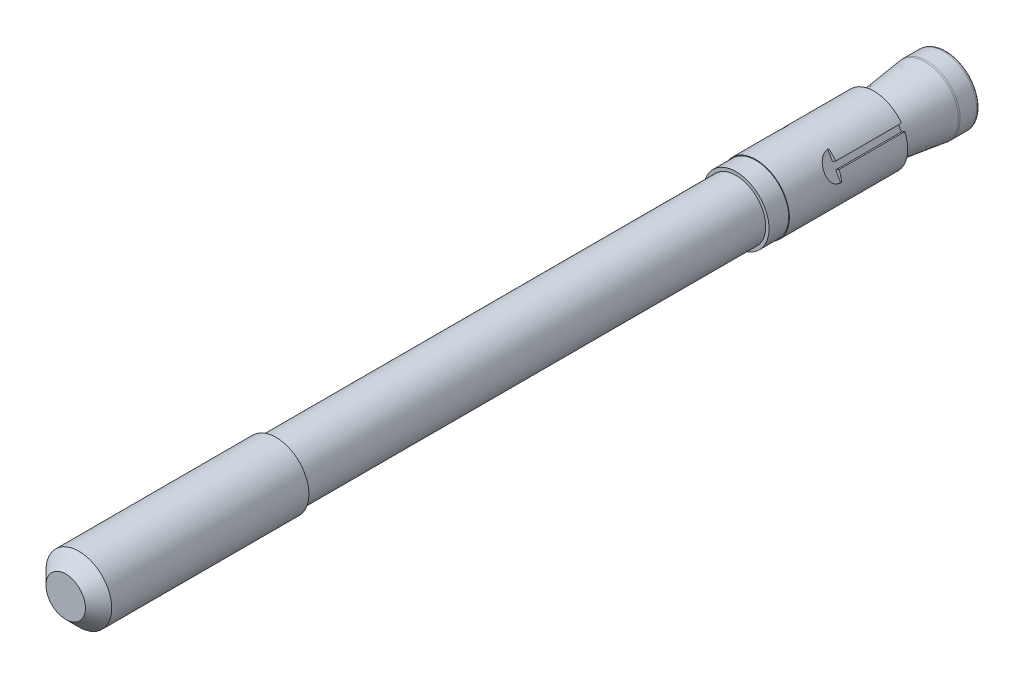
ISO-10303-21;
HEADER;
FILE_DESCRIPTION(('STEP AP214'),'2;1');
FILE_NAME('part.step','',(''),(''),'','','');
FILE_SCHEMA(('AUTOMOTIVE_DESIGN { 1 0 10303 214 1 1 1 1 }'));
ENDSEC;
DATA;
#1=APPLICATION_CONTEXT('core data for automotive mechanical design processes');
#2=APPLICATION_PROTOCOL_DEFINITION('international standard','automotive_design',2000,#1);
#3=PRODUCT_CONTEXT('',#1,'mechanical');
#4=PRODUCT('Part','Part','',(#3));
#5=PRODUCT_RELATED_PRODUCT_CATEGORY('part','',(#4));
#6=PRODUCT_DEFINITION_FORMATION('','',#4);
#7=PRODUCT_DEFINITION_CONTEXT('part definition',#1,'design');
#8=PRODUCT_DEFINITION('design','',#6,#7);
#9=PRODUCT_DEFINITION_SHAPE('','',#8);
#10=(LENGTH_UNIT() NAMED_UNIT(*) SI_UNIT(.MILLI.,.METRE.));
#11=(NAMED_UNIT(*) PLANE_ANGLE_UNIT() SI_UNIT($,.RADIAN.));
#12=(NAMED_UNIT(*) SI_UNIT($,.STERADIAN.) SOLID_ANGLE_UNIT());
#13=UNCERTAINTY_MEASURE_WITH_UNIT(LENGTH_MEASURE(1.E-05),#10,'distance_accuracy_value','');
#14=(GEOMETRIC_REPRESENTATION_CONTEXT(3) GLOBAL_UNCERTAINTY_ASSIGNED_CONTEXT((#13)) GLOBAL_UNIT_ASSIGNED_CONTEXT((#10,
#11,#12)) REPRESENTATION_CONTEXT('',''));
#15=CARTESIAN_POINT('',(0.,0.,0.));
#16=DIRECTION('',(0.,0.,1.));
#17=DIRECTION('',(1.,0.,0.));
#18=AXIS2_PLACEMENT_3D('',#15,#16,#17);
#19=CARTESIAN_POINT('',(0.,-2.53157326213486,-102.));
#20=DIRECTION('',(0.,0.,-1.));
#21=DIRECTION('',(-1.,0.,0.));
#22=AXIS2_PLACEMENT_3D('',#19,#20,#21);
#23=PLANE('',#22);
#24=CARTESIAN_POINT('',(0.,0.012284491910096,-102.));
#25=DIRECTION('',(0.,0.,1.));
#26=DIRECTION('',(0.,-1.,0.));
#27=AXIS2_PLACEMENT_3D('',#24,#25,#26);
#28=CIRCLE('',#27,4.5877155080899);
#29=CARTESIAN_POINT('',(0.,-4.57543101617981,-102.));
#30=VERTEX_POINT('',#29);
#31=EDGE_CURVE('E257',#30,#30,#28,.T.);
#32=ORIENTED_EDGE('',*,*,#31,.F.);
#33=EDGE_LOOP('',(#32));
#34=FACE_BOUND('',#33,.T.);
#35=ADVANCED_FACE('F15',(#34),#23,.T.);
#36=CARTESIAN_POINT('',(0.,0.012284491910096,-101.5));
#37=DIRECTION('',(0.,0.,1.));
#38=DIRECTION('',(1.,0.,0.));
#39=AXIS2_PLACEMENT_3D('',#36,#37,#38);
#40=TOROIDAL_SURFACE('',#39,4.5877155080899,0.5);
#41=CARTESIAN_POINT('',(0.,0.012284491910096,-101.5));
#42=DIRECTION('',(0.,0.,1.));
#43=DIRECTION('',(0.,-1.,0.));
#44=AXIS2_PLACEMENT_3D('',#41,#42,#43);
#45=CIRCLE('',#44,5.0877155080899);
#46=CARTESIAN_POINT('',(0.,-5.07543101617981,-101.5));
#47=VERTEX_POINT('',#46);
#48=EDGE_CURVE('E785',#47,#47,#45,.T.);
#49=ORIENTED_EDGE('',*,*,#48,.F.);
#50=EDGE_LOOP('',(#49));
#51=FACE_BOUND('',#50,.T.);
#52=ORIENTED_EDGE('',*,*,#31,.T.);
#53=EDGE_LOOP('',(#52));
#54=FACE_BOUND('',#53,.T.);
#55=ADVANCED_FACE('F241',(#51,#54),#40,.T.);
#56=CARTESIAN_POINT('',(0.,0.012284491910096,-100.5));
#57=DIRECTION('',(0.,0.,1.));
#58=DIRECTION('',(0.,-1.,0.));
#59=AXIS2_PLACEMENT_3D('',#56,#57,#58);
#60=CYLINDRICAL_SURFACE('',#59,5.0877155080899);
#61=ORIENTED_EDGE('',*,*,#48,.T.);
#62=EDGE_LOOP('',(#61));
#63=FACE_BOUND('',#62,.T.);
#64=CARTESIAN_POINT('',(0.,0.012284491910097,-99.));
#65=DIRECTION('',(0.,0.,1.));
#66=DIRECTION('',(1.,0.,0.));
#67=AXIS2_PLACEMENT_3D('',#64,#65,#66);
#68=CIRCLE('',#67,5.0877155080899);
#69=CARTESIAN_POINT('',(5.0877155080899,0.012284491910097,-99.));
#70=VERTEX_POINT('',#69);
#71=EDGE_CURVE('E224',#70,#70,#68,.T.);
#72=ORIENTED_EDGE('',*,*,#71,.F.);
#73=EDGE_LOOP('',(#72));
#74=FACE_BOUND('',#73,.T.);
#75=ADVANCED_FACE('F237',(#63,#74),#60,.T.);
#76=CARTESIAN_POINT('',(0.,0.012284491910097,-99.));
#77=DIRECTION('',(0.,0.,1.));
#78=DIRECTION('',(1.,0.,0.));
#79=AXIS2_PLACEMENT_3D('',#76,#77,#78);
#80=TOROIDAL_SURFACE('',#79,3.08771550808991,2.);
#81=ORIENTED_EDGE('',*,*,#71,.T.);
#82=EDGE_LOOP('',(#81));
#83=FACE_BOUND('',#82,.T.);
#84=CARTESIAN_POINT('',(0.,0.0122844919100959,-98.7480076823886));
#85=DIRECTION('',(0.,0.,-1.));
#86=DIRECTION('',(0.,-1.,0.));
#87=AXIS2_PLACEMENT_3D('',#84,#85,#86);
#88=CIRCLE('',#87,5.07177696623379);
#89=CARTESIAN_POINT('',(0.,-5.05949247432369,-98.7480076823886));
#90=VERTEX_POINT('',#89);
#91=EDGE_CURVE('E614',#90,#90,#88,.F.);
#92=ORIENTED_EDGE('',*,*,#91,.F.);
#93=EDGE_LOOP('',(#92));
#94=FACE_BOUND('',#93,.T.);
#95=ADVANCED_FACE('F232',(#83,#94),#80,.T.);
#96=CARTESIAN_POINT('',(3.89711431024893,2.25000001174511,-84.394199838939));
#97=DIRECTION('',(0.866025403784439,0.5,0.));
#98=DIRECTION('',(-0.5,0.866025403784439,0.));
#99=AXIS2_PLACEMENT_3D('',#96,#97,#98);
#100=PLANE('',#99);
#101=DIRECTION('',(0.,0.,1.));
#102=VECTOR('',#101,1.);
#103=CARTESIAN_POINT('',(3.64711431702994,2.68301270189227,-81.));
#104=LINE('',#103,#102);
#105=CARTESIAN_POINT('',(3.64711431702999,2.6830127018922,-91.));
#106=VERTEX_POINT('',#105);
#107=CARTESIAN_POINT('',(3.64711431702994,2.68301270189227,-81.));
#108=VERTEX_POINT('',#107);
#109=EDGE_CURVE('E610',#106,#108,#104,.T.);
#110=ORIENTED_EDGE('',*,*,#109,.T.);
#111=DIRECTION('',(-0.5,0.866025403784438,0.));
#112=VECTOR('',#111,1.);
#113=CARTESIAN_POINT('',(3.64711431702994,2.68301270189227,-81.));
#114=LINE('',#113,#112);
#115=CARTESIAN_POINT('',(2.89711431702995,3.98205080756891,-81.));
#116=VERTEX_POINT('',#115);
#117=EDGE_CURVE('E133',#108,#116,#114,.T.);
#118=ORIENTED_EDGE('',*,*,#117,.T.);
#119=CARTESIAN_POINT('',(3.89711431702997,2.25,-80.9999996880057));
#120=DIRECTION('',(0.866025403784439,0.5,0.));
#121=DIRECTION('',(-0.5,0.866025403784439,0.));
#122=AXIS2_PLACEMENT_3D('',#119,#120,#121);
#123=CIRCLE('',#122,2.);
#124=CARTESIAN_POINT('',(4.89711431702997,0.517949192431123,-80.9999996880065));
#125=VERTEX_POINT('',#124);
#126=EDGE_CURVE('E19',#116,#125,#123,.T.);
#127=ORIENTED_EDGE('',*,*,#126,.T.);
#128=DIRECTION('',(-0.5,0.866025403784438,0.));
#129=VECTOR('',#128,1.);
#130=CARTESIAN_POINT('',(4.89711431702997,0.517949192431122,-80.9999996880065));
#131=LINE('',#130,#129);
#132=CARTESIAN_POINT('',(4.14711431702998,1.81698729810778,-80.9999996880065));
#133=VERTEX_POINT('',#132);
#134=EDGE_CURVE('E141',#125,#133,#131,.T.);
#135=ORIENTED_EDGE('',*,*,#134,.T.);
#136=DIRECTION('',(0.,0.,1.));
#137=VECTOR('',#136,1.);
#138=CARTESIAN_POINT('',(4.14711431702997,1.81698729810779,-91.));
#139=LINE('',#138,#137);
#140=CARTESIAN_POINT('',(4.14711431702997,1.81698729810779,-91.));
#141=VERTEX_POINT('',#140);
#142=EDGE_CURVE('E227',#133,#141,#139,.F.);
#143=ORIENTED_EDGE('',*,*,#142,.T.);
#144=DIRECTION('',(-0.5,0.866025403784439,0.));
#145=VECTOR('',#144,1.);
#146=CARTESIAN_POINT('',(3.89711431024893,2.25000001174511,-91.));
#147=LINE('',#146,#145);
#148=EDGE_CURVE('E214',#141,#106,#147,.T.);
#149=ORIENTED_EDGE('',*,*,#148,.T.);
#150=EDGE_LOOP('',(#110,#118,#127,#135,#143,#149));
#151=FACE_BOUND('',#150,.T.);
#152=ADVANCED_FACE('F236',(#151),#100,.T.);
#153=CARTESIAN_POINT('',(-3.89711432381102,2.24999998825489,-84.394199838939));
#154=DIRECTION('',(0.866025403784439,-0.5,0.));
#155=DIRECTION('',(0.5,0.866025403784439,0.));
#156=AXIS2_PLACEMENT_3D('',#153,#154,#155);
#157=PLANE('',#156);
#158=DIRECTION('',(-0.5,-0.866025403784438,0.));
#159=VECTOR('',#158,1.);
#160=CARTESIAN_POINT('',(-2.89711431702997,3.98205080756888,-80.9999996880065));
#161=LINE('',#160,#159);
#162=CARTESIAN_POINT('',(-2.89711431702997,3.98205080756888,-80.9999996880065));
#163=VERTEX_POINT('',#162);
#164=CARTESIAN_POINT('',(-3.64711431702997,2.68301270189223,-80.9999996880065));
#165=VERTEX_POINT('',#164);
#166=EDGE_CURVE('E215',#163,#165,#161,.T.);
#167=ORIENTED_EDGE('',*,*,#166,.T.);
#168=DIRECTION('',(0.,0.,1.));
#169=VECTOR('',#168,1.);
#170=CARTESIAN_POINT('',(-3.64711431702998,2.68301270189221,-91.));
#171=LINE('',#170,#169);
#172=CARTESIAN_POINT('',(-3.64711431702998,2.68301270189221,-91.));
#173=VERTEX_POINT('',#172);
#174=EDGE_CURVE('E219',#165,#173,#171,.F.);
#175=ORIENTED_EDGE('',*,*,#174,.T.);
#176=DIRECTION('',(0.5,0.866025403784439,0.));
#177=VECTOR('',#176,1.);
#178=CARTESIAN_POINT('',(-3.89711432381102,2.24999998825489,-91.));
#179=LINE('',#178,#177);
#180=CARTESIAN_POINT('',(-4.14711431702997,1.81698729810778,-91.));
#181=VERTEX_POINT('',#180);
#182=EDGE_CURVE('E211',#181,#173,#179,.T.);
#183=ORIENTED_EDGE('',*,*,#182,.F.);
#184=DIRECTION('',(0.,0.,1.));
#185=VECTOR('',#184,1.);
#186=CARTESIAN_POINT('',(-4.14711431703,1.81698729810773,-81.));
#187=LINE('',#186,#185);
#188=CARTESIAN_POINT('',(-4.14711431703,1.81698729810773,-81.));
#189=VERTEX_POINT('',#188);
#190=EDGE_CURVE('E589',#181,#189,#187,.T.);
#191=ORIENTED_EDGE('',*,*,#190,.T.);
#192=DIRECTION('',(-0.5,-0.866025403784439,0.));
#193=VECTOR('',#192,1.);
#194=CARTESIAN_POINT('',(-4.14711431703,1.81698729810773,-81.));
#195=LINE('',#194,#193);
#196=CARTESIAN_POINT('',(-4.89711431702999,0.517949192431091,-81.));
#197=VERTEX_POINT('',#196);
#198=EDGE_CURVE('E207',#189,#197,#195,.T.);
#199=ORIENTED_EDGE('',*,*,#198,.T.);
#200=CARTESIAN_POINT('',(-3.89711431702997,2.25,-80.9999996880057));
#201=DIRECTION('',(-0.866025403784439,0.5,0.));
#202=DIRECTION('',(-0.5,-0.866025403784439,0.));
#203=AXIS2_PLACEMENT_3D('',#200,#201,#202);
#204=CIRCLE('',#203,2.);
#205=EDGE_CURVE('E598',#197,#163,#204,.T.);
#206=ORIENTED_EDGE('',*,*,#205,.T.);
#207=EDGE_LOOP('',(#167,#175,#183,#191,#199,#206));
#208=FACE_BOUND('',#207,.T.);
#209=ADVANCED_FACE('F388',(#208),#157,.F.);
#210=CARTESIAN_POINT('',(0.,-4.5,-81.8452759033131));
#211=DIRECTION('',(0.,1.,0.));
#212=DIRECTION('',(0.,0.,1.));
#213=AXIS2_PLACEMENT_3D('',#210,#211,#212);
#214=PLANE('',#213);
#215=DIRECTION('',(0.,0.,1.));
#216=VECTOR('',#215,1.);
#217=CARTESIAN_POINT('',(-0.500000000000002,-4.5,-91.));
#218=LINE('',#217,#216);
#219=CARTESIAN_POINT('',(-0.499999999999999,-4.5,-81.));
#220=VERTEX_POINT('',#219);
#221=CARTESIAN_POINT('',(-0.500000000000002,-4.5,-91.));
#222=VERTEX_POINT('',#221);
#223=EDGE_CURVE('E206',#220,#222,#218,.F.);
#224=ORIENTED_EDGE('',*,*,#223,.T.);
#225=DIRECTION('',(1.,0.,0.));
#226=VECTOR('',#225,1.);
#227=CARTESIAN_POINT('',(0.,-4.5,-91.));
#228=LINE('',#227,#226);
#229=CARTESIAN_POINT('',(0.500000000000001,-4.5,-91.));
#230=VERTEX_POINT('',#229);
#231=EDGE_CURVE('E617',#230,#222,#228,.F.);
#232=ORIENTED_EDGE('',*,*,#231,.F.);
#233=DIRECTION('',(0.,0.,-1.));
#234=VECTOR('',#233,1.);
#235=CARTESIAN_POINT('',(0.500000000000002,-4.5,-81.));
#236=LINE('',#235,#234);
#237=CARTESIAN_POINT('',(0.500000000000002,-4.5,-81.));
#238=VERTEX_POINT('',#237);
#239=EDGE_CURVE('E621',#230,#238,#236,.F.);
#240=ORIENTED_EDGE('',*,*,#239,.T.);
#241=DIRECTION('',(-1.,0.,0.));
#242=VECTOR('',#241,1.);
#243=CARTESIAN_POINT('',(2.,-4.5,-81.));
#244=LINE('',#243,#242);
#245=CARTESIAN_POINT('',(2.,-4.5,-81.));
#246=VERTEX_POINT('',#245);
#247=EDGE_CURVE('E631',#238,#246,#244,.F.);
#248=ORIENTED_EDGE('',*,*,#247,.T.);
#249=CARTESIAN_POINT('',(0.,-4.5,-81.));
#250=DIRECTION('',(0.,-1.,0.));
#251=DIRECTION('',(0.,0.,-1.));
#252=AXIS2_PLACEMENT_3D('',#249,#250,#251);
#253=CIRCLE('',#252,2.);
#254=CARTESIAN_POINT('',(0.499999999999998,-4.5,-79.0635083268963));
#255=VERTEX_POINT('',#254);
#256=EDGE_CURVE('E641',#246,#255,#253,.T.);
#257=ORIENTED_EDGE('',*,*,#256,.T.);
#258=DIRECTION('',(0.,0.,-1.));
#259=VECTOR('',#258,1.);
#260=CARTESIAN_POINT('',(0.5,-4.5,-73.));
#261=LINE('',#260,#259);
#262=CARTESIAN_POINT('',(0.5,-4.5,-73.));
#263=VERTEX_POINT('',#262);
#264=EDGE_CURVE('E635',#255,#263,#261,.F.);
#265=ORIENTED_EDGE('',*,*,#264,.T.);
#266=DIRECTION('',(1.,0.,0.));
#267=VECTOR('',#266,1.);
#268=CARTESIAN_POINT('',(0.,-4.5,-73.));
#269=LINE('',#268,#267);
#270=CARTESIAN_POINT('',(-0.5,-4.5,-73.));
#271=VERTEX_POINT('',#270);
#272=EDGE_CURVE('E213',#271,#263,#269,.T.);
#273=ORIENTED_EDGE('',*,*,#272,.F.);
#274=DIRECTION('',(0.,0.,1.));
#275=VECTOR('',#274,1.);
#276=CARTESIAN_POINT('',(-0.5,-4.5,-79.0635083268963));
#277=LINE('',#276,#275);
#278=CARTESIAN_POINT('',(-0.5,-4.5,-79.0635083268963));
#279=VERTEX_POINT('',#278);
#280=EDGE_CURVE('E196',#271,#279,#277,.F.);
#281=ORIENTED_EDGE('',*,*,#280,.T.);
#282=CARTESIAN_POINT('',(0.,-4.5,-81.));
#283=DIRECTION('',(0.,-1.,0.));
#284=DIRECTION('',(0.,0.,-1.));
#285=AXIS2_PLACEMENT_3D('',#282,#283,#284);
#286=CIRCLE('',#285,2.);
#287=CARTESIAN_POINT('',(-2.,-4.5,-81.));
#288=VERTEX_POINT('',#287);
#289=EDGE_CURVE('E652',#279,#288,#286,.T.);
#290=ORIENTED_EDGE('',*,*,#289,.T.);
#291=DIRECTION('',(-1.,0.,0.));
#292=VECTOR('',#291,1.);
#293=CARTESIAN_POINT('',(-0.499999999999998,-4.5,-81.));
#294=LINE('',#293,#292);
#295=EDGE_CURVE('E202',#288,#220,#294,.F.);
#296=ORIENTED_EDGE('',*,*,#295,.T.);
#297=EDGE_LOOP('',(#224,#232,#240,#248,#257,#265,#273,#281,#290,#296));
#298=FACE_BOUND('',#297,.T.);
#299=ADVANCED_FACE('F385',(#298),#214,.F.);
#300=CARTESIAN_POINT('',(0.,0.012284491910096,-98.7480076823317));
#301=DIRECTION('',(0.,0.,-1.));
#302=DIRECTION('',(-1.,0.,0.));
#303=AXIS2_PLACEMENT_3D('',#300,#301,#302);
#304=CONICAL_SURFACE('',#303,5.07177696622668,0.126331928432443);
#305=ORIENTED_EDGE('',*,*,#91,.T.);
#306=EDGE_LOOP('',(#305));
#307=FACE_BOUND('',#306,.T.);
#308=CARTESIAN_POINT('',(0.,0.012284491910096,-90.9999999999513));
#309=DIRECTION('',(0.,0.,-1.));
#310=DIRECTION('',(-1.,0.,0.));
#311=AXIS2_PLACEMENT_3D('',#308,#309,#310);
#312=CIRCLE('',#311,4.08771550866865);
#313=CARTESIAN_POINT('',(-4.08771550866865,0.012284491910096,-90.9999999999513));
#314=VERTEX_POINT('',#313);
#315=EDGE_CURVE('E688',#314,#314,#312,.T.);
#316=ORIENTED_EDGE('',*,*,#315,.T.);
#317=EDGE_LOOP('',(#316));
#318=FACE_BOUND('',#317,.T.);
#319=ADVANCED_FACE('F381',(#307,#318),#304,.T.);
#320=CARTESIAN_POINT('',(4.14711431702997,1.81698729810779,-91.));
#321=DIRECTION('',(0.5,-0.866025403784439,0.));
#322=DIRECTION('',(0.866025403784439,0.5,0.));
#323=AXIS2_PLACEMENT_3D('',#320,#321,#322);
#324=PLANE('',#323);
#325=DIRECTION('',(-0.866025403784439,-0.5,0.));
#326=VECTOR('',#325,1.);
#327=CARTESIAN_POINT('',(4.64545219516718,2.10470280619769,-91.));
#328=LINE('',#327,#326);
#329=CARTESIAN_POINT('',(4.64545219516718,2.1047028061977,-91.));
#330=VERTEX_POINT('',#329);
#331=EDGE_CURVE('E702',#330,#141,#328,.T.);
#332=ORIENTED_EDGE('',*,*,#331,.T.);
#333=ORIENTED_EDGE('',*,*,#142,.F.);
#334=DIRECTION('',(0.866025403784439,0.5,0.));
#335=VECTOR('',#334,1.);
#336=CARTESIAN_POINT('',(4.14711431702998,1.81698729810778,-80.9999996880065));
#337=LINE('',#336,#335);
#338=CARTESIAN_POINT('',(4.64545219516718,2.10470280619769,-80.9999996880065));
#339=VERTEX_POINT('',#338);
#340=EDGE_CURVE('E226',#133,#339,#337,.T.);
#341=ORIENTED_EDGE('',*,*,#340,.T.);
#342=DIRECTION('',(0.,0.,-1.));
#343=VECTOR('',#342,1.);
#344=CARTESIAN_POINT('',(4.64545219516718,2.1047028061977,-73.));
#345=LINE('',#344,#343);
#346=EDGE_CURVE('E684',#330,#339,#345,.F.);
#347=ORIENTED_EDGE('',*,*,#346,.F.);
#348=EDGE_LOOP('',(#332,#333,#341,#347));
#349=FACE_BOUND('',#348,.T.);
#350=ADVANCED_FACE('F377',(#349),#324,.F.);
#351=CARTESIAN_POINT('',(4.14711431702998,1.81698729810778,-80.9999996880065));
#352=DIRECTION('',(0.,0.,-1.));
#353=DIRECTION('',(-1.,0.,0.));
#354=AXIS2_PLACEMENT_3D('',#351,#352,#353);
#355=PLANE('',#354);
#356=ORIENTED_EDGE('',*,*,#340,.F.);
#357=ORIENTED_EDGE('',*,*,#134,.F.);
#358=DIRECTION('',(0.866025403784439,0.5,0.));
#359=VECTOR('',#358,1.);
#360=CARTESIAN_POINT('',(4.89711431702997,0.517949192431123,-80.9999996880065));
#361=LINE('',#360,#359);
#362=CARTESIAN_POINT('',(5.06294228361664,0.613690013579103,-80.9999996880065));
#363=VERTEX_POINT('',#362);
#364=EDGE_CURVE('E222',#125,#363,#361,.T.);
#365=ORIENTED_EDGE('',*,*,#364,.T.);
#366=CARTESIAN_POINT('',(0.,0.,-80.9999996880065));
#367=DIRECTION('',(0.,0.,-1.));
#368=DIRECTION('',(-1.,0.,0.));
#369=AXIS2_PLACEMENT_3D('',#366,#367,#368);
#370=CIRCLE('',#369,5.1);
#371=EDGE_CURVE('E687',#339,#363,#370,.T.);
#372=ORIENTED_EDGE('',*,*,#371,.F.);
#373=EDGE_LOOP('',(#356,#357,#365,#372));
#374=FACE_BOUND('',#373,.T.);
#375=ADVANCED_FACE('F373',(#374),#355,.F.);
#376=CARTESIAN_POINT('',(3.89711431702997,2.25,-80.9999996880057));
#377=DIRECTION('',(0.866025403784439,0.5,0.));
#378=DIRECTION('',(-0.5,0.866025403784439,0.));
#379=AXIS2_PLACEMENT_3D('',#376,#377,#378);
#380=CYLINDRICAL_SURFACE('',#379,2.);
#381=ORIENTED_EDGE('',*,*,#364,.F.);
#382=ORIENTED_EDGE('',*,*,#126,.F.);
#383=DIRECTION('',(0.866025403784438,0.500000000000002,0.));
#384=VECTOR('',#383,1.);
#385=CARTESIAN_POINT('',(2.89711431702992,3.98205080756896,-81.));
#386=LINE('',#385,#384);
#387=CARTESIAN_POINT('',(3.06294228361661,4.07779162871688,-81.));
#388=VERTEX_POINT('',#387);
#389=EDGE_CURVE('E221',#116,#388,#386,.T.);
#390=ORIENTED_EDGE('',*,*,#389,.T.);
#391=CARTESIAN_POINT('',(5.06294228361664,0.613690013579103,-80.9999996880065));
#392=CARTESIAN_POINT('',(5.06293690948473,0.613677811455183,-80.9460966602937));
#393=CARTESIAN_POINT('',(5.06265710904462,0.616041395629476,-80.8921995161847));
#394=CARTESIAN_POINT('',(5.06150987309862,0.625426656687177,-80.7848377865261));
#395=CARTESIAN_POINT('',(5.0606426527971,0.632446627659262,-80.7313730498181));
#396=CARTESIAN_POINT('',(5.05828633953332,0.651015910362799,-80.6254587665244));
#397=CARTESIAN_POINT('',(5.05679962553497,0.662547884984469,-80.5730061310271));
#398=CARTESIAN_POINT('',(5.05313199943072,0.689961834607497,-80.4692875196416));
#399=CARTESIAN_POINT('',(5.05095104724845,0.705844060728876,-80.4180216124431));
#400=CARTESIAN_POINT('',(5.04323502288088,0.7596758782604,-80.2666263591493));
#401=CARTESIAN_POINT('',(5.03652297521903,0.803847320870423,-80.168695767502));
#402=CARTESIAN_POINT('',(5.01902587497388,0.906689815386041,-79.9811668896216));
#403=CARTESIAN_POINT('',(5.00823711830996,0.965374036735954,-79.8915762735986));
#404=CARTESIAN_POINT('',(4.98084773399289,1.09816505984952,-79.7184035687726));
#405=CARTESIAN_POINT('',(4.96398695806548,1.17288924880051,-79.6353349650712));
#406=CARTESIAN_POINT('',(4.92337674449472,1.3331113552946,-79.4822813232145));
#407=CARTESIAN_POINT('',(4.89962592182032,1.41861143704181,-79.4122989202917));
#408=CARTESIAN_POINT('',(4.84316777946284,1.60098825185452,-79.2848356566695));
#409=CARTESIAN_POINT('',(4.81015627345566,1.69817255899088,-79.2279262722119));
#410=CARTESIAN_POINT('',(4.73497496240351,1.89772367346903,-79.1320708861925));
#411=CARTESIAN_POINT('',(4.6928088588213,2.00008837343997,-79.0931176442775));
#412=CARTESIAN_POINT('',(4.60164923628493,2.20146809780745,-79.0361185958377));
#413=CARTESIAN_POINT('',(4.55306691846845,2.30041607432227,-79.0171807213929));
#414=CARTESIAN_POINT('',(4.44869105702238,2.49628626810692,-78.9978819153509));
#415=CARTESIAN_POINT('',(4.39289996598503,2.59320916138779,-78.997514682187));
#416=CARTESIAN_POINT('',(4.27906834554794,2.77680010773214,-79.0148695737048));
#417=CARTESIAN_POINT('',(4.22131219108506,2.86373928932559,-79.0316154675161));
#418=CARTESIAN_POINT('',(4.10296535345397,3.03086870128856,-79.0810662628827));
#419=CARTESIAN_POINT('',(4.04237450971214,3.1110585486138,-79.1137720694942));
#420=CARTESIAN_POINT('',(3.9197352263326,3.26426975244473,-79.1946196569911));
#421=CARTESIAN_POINT('',(3.85767853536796,3.3371660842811,-79.2429847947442));
#422=CARTESIAN_POINT('',(3.73546922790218,3.47342177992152,-79.3535735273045));
#423=CARTESIAN_POINT('',(3.67531727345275,3.53677785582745,-79.4158018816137));
#424=CARTESIAN_POINT('',(3.55575071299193,3.65708642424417,-79.5569463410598));
#425=CARTESIAN_POINT('',(3.49662399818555,3.71337937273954,-79.6366696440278));
#426=CARTESIAN_POINT('',(3.38636426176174,3.81420142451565,-79.8082390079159));
#427=CARTESIAN_POINT('',(3.33523471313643,3.85872542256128,-79.9000903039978));
#428=CARTESIAN_POINT('',(3.24278715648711,3.93676246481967,-80.0964086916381));
#429=CARTESIAN_POINT('',(3.2017681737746,3.96994912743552,-80.201147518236));
#430=CARTESIAN_POINT('',(3.13449218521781,4.02328579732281,-80.4183175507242));
#431=CARTESIAN_POINT('',(3.10820951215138,4.0434584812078,-80.5307349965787));
#432=CARTESIAN_POINT('',(3.08132400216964,4.06393423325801,-80.7035868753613));
#433=CARTESIAN_POINT('',(3.07444846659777,4.06912984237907,-80.7625549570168));
#434=CARTESIAN_POINT('',(3.06525368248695,4.07605631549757,-80.8810032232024));
#435=CARTESIAN_POINT('',(3.06293113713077,4.07778968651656,-80.940483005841));
#436=CARTESIAN_POINT('',(3.06294228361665,4.07779162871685,-80.9999999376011));
#437=B_SPLINE_CURVE_WITH_KNOTS('',3,(#391,#392,#393,#394,#395,#396,#397,#398,#399,#400,#401,
#402,#403,#404,#405,#406,#407,#408,#409,#410,#411,#412,#413,#414,#415,#416,#417,#418,#419,#420,
#421,#422,#423,#424,#425,#426,#427,#428,#429,#430,#431,#432,#433,#434,#435,#436),.UNSPECIFIED.,
.F.,.F.,(4,2,2,2,2,2,2,2,2,2,2,2,2,2,2,2,2,2,2,2,2,2,4),(0.,0.161646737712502,0.323234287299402,
0.484206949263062,0.64518890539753,0.966539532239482,1.28818284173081,1.62567266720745,
1.96323038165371,2.31352736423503,2.6636829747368,2.99747327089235,3.3311503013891,
3.64679996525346,3.96246753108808,4.28285211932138,4.6033468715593,4.94413641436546,
5.28507354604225,5.63513020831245,5.98457524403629,6.16311349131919,6.34152241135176),.UNSPECIFIED.);
#438=EDGE_CURVE('E325',#363,#388,#437,.T.);
#439=ORIENTED_EDGE('',*,*,#438,.F.);
#440=EDGE_LOOP('',(#381,#382,#390,#439));
#441=FACE_BOUND('',#440,.T.);
#442=ADVANCED_FACE('F368',(#441),#380,.F.);
#443=CARTESIAN_POINT('',(2.89711431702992,3.98205080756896,-81.));
#444=DIRECTION('',(0.,0.,-1.));
#445=DIRECTION('',(-1.,0.,0.));
#446=AXIS2_PLACEMENT_3D('',#443,#444,#445);
#447=PLANE('',#446);
#448=ORIENTED_EDGE('',*,*,#389,.F.);
#449=ORIENTED_EDGE('',*,*,#117,.F.);
#450=DIRECTION('',(-0.866025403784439,-0.5,0.));
#451=VECTOR('',#450,1.);
#452=CARTESIAN_POINT('',(3.64711431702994,2.68301270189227,-81.));
#453=LINE('',#452,#451);
#454=CARTESIAN_POINT('',(4.14545219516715,2.97072820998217,-81.));
#455=VERTEX_POINT('',#454);
#456=EDGE_CURVE('E608',#108,#455,#453,.F.);
#457=ORIENTED_EDGE('',*,*,#456,.T.);
#458=CARTESIAN_POINT('',(0.,0.,-81.));
#459=DIRECTION('',(0.,0.,-1.));
#460=DIRECTION('',(-1.,0.,0.));
#461=AXIS2_PLACEMENT_3D('',#458,#459,#460);
#462=CIRCLE('',#461,5.1);
#463=EDGE_CURVE('E607',#388,#455,#462,.T.);
#464=ORIENTED_EDGE('',*,*,#463,.F.);
#465=EDGE_LOOP('',(#448,#449,#457,#464));
#466=FACE_BOUND('',#465,.T.);
#467=ADVANCED_FACE('F365',(#466),#447,.F.);
#468=CARTESIAN_POINT('',(3.64711431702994,2.68301270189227,-81.));
#469=DIRECTION('',(-0.5,0.866025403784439,0.));
#470=DIRECTION('',(-0.866025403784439,-0.5,0.));
#471=AXIS2_PLACEMENT_3D('',#468,#469,#470);
#472=PLANE('',#471);
#473=ORIENTED_EDGE('',*,*,#456,.F.);
#474=ORIENTED_EDGE('',*,*,#109,.F.);
#475=DIRECTION('',(0.866025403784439,0.5,0.));
#476=VECTOR('',#475,1.);
#477=CARTESIAN_POINT('',(3.64711431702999,2.6830127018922,-91.));
#478=LINE('',#477,#476);
#479=CARTESIAN_POINT('',(4.14545219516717,2.97072820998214,-91.));
#480=VERTEX_POINT('',#479);
#481=EDGE_CURVE('E676',#106,#480,#478,.T.);
#482=ORIENTED_EDGE('',*,*,#481,.T.);
#483=DIRECTION('',(0.,0.,-1.));
#484=VECTOR('',#483,1.);
#485=CARTESIAN_POINT('',(4.14545219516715,2.97072820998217,-73.));
#486=LINE('',#485,#484);
#487=EDGE_CURVE('E604',#455,#480,#486,.T.);
#488=ORIENTED_EDGE('',*,*,#487,.F.);
#489=EDGE_LOOP('',(#473,#474,#482,#488));
#490=FACE_BOUND('',#489,.T.);
#491=ADVANCED_FACE('F361',(#490),#472,.F.);
#492=CARTESIAN_POINT('',(-3.64711431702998,2.68301270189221,-91.));
#493=DIRECTION('',(0.5,0.866025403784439,0.));
#494=DIRECTION('',(-0.866025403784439,0.5,0.));
#495=AXIS2_PLACEMENT_3D('',#492,#493,#494);
#496=PLANE('',#495);
#497=DIRECTION('',(0.866025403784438,-0.5,0.));
#498=VECTOR('',#497,1.);
#499=CARTESIAN_POINT('',(-4.14545219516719,2.97072820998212,-91.));
#500=LINE('',#499,#498);
#501=CARTESIAN_POINT('',(-4.14545219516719,2.97072820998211,-91.));
#502=VERTEX_POINT('',#501);
#503=EDGE_CURVE('E671',#502,#173,#500,.T.);
#504=ORIENTED_EDGE('',*,*,#503,.T.);
#505=ORIENTED_EDGE('',*,*,#174,.F.);
#506=DIRECTION('',(-0.866025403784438,0.500000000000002,0.));
#507=VECTOR('',#506,1.);
#508=CARTESIAN_POINT('',(-3.64711431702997,2.68301270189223,-80.9999996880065));
#509=LINE('',#508,#507);
#510=CARTESIAN_POINT('',(-4.14545219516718,2.97072820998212,-80.9999996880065));
#511=VERTEX_POINT('',#510);
#512=EDGE_CURVE('E218',#165,#511,#509,.T.);
#513=ORIENTED_EDGE('',*,*,#512,.T.);
#514=DIRECTION('',(0.,0.,-1.));
#515=VECTOR('',#514,1.);
#516=CARTESIAN_POINT('',(-4.14545219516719,2.97072820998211,-73.));
#517=LINE('',#516,#515);
#518=EDGE_CURVE('E600',#502,#511,#517,.F.);
#519=ORIENTED_EDGE('',*,*,#518,.F.);
#520=EDGE_LOOP('',(#504,#505,#513,#519));
#521=FACE_BOUND('',#520,.T.);
#522=ADVANCED_FACE('F357',(#521),#496,.F.);
#523=CARTESIAN_POINT('',(-3.64711431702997,2.68301270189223,-80.9999996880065));
#524=DIRECTION('',(0.,0.,-1.));
#525=DIRECTION('',(-1.,0.,0.));
#526=AXIS2_PLACEMENT_3D('',#523,#524,#525);
#527=PLANE('',#526);
#528=ORIENTED_EDGE('',*,*,#512,.F.);
#529=ORIENTED_EDGE('',*,*,#166,.F.);
#530=DIRECTION('',(-0.866025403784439,0.5,0.));
#531=VECTOR('',#530,1.);
#532=CARTESIAN_POINT('',(-2.89711431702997,3.98205080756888,-80.9999996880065));
#533=LINE('',#532,#531);
#534=CARTESIAN_POINT('',(-3.06294228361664,4.07779162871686,-80.9999996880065));
#535=VERTEX_POINT('',#534);
#536=EDGE_CURVE('E210',#163,#535,#533,.T.);
#537=ORIENTED_EDGE('',*,*,#536,.T.);
#538=CARTESIAN_POINT('',(0.,0.,-80.9999996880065));
#539=DIRECTION('',(0.,0.,-1.));
#540=DIRECTION('',(-1.,0.,0.));
#541=AXIS2_PLACEMENT_3D('',#538,#539,#540);
#542=CIRCLE('',#541,5.1);
#543=EDGE_CURVE('E343',#511,#535,#542,.T.);
#544=ORIENTED_EDGE('',*,*,#543,.F.);
#545=EDGE_LOOP('',(#528,#529,#537,#544));
#546=FACE_BOUND('',#545,.T.);
#547=ADVANCED_FACE('F352',(#546),#527,.F.);
#548=CARTESIAN_POINT('',(-3.89711431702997,2.25,-80.9999996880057));
#549=DIRECTION('',(-0.866025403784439,0.5,0.));
#550=DIRECTION('',(-0.5,-0.866025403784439,0.));
#551=AXIS2_PLACEMENT_3D('',#548,#549,#550);
#552=CYLINDRICAL_SURFACE('',#551,2.);
#553=ORIENTED_EDGE('',*,*,#536,.F.);
#554=ORIENTED_EDGE('',*,*,#205,.F.);
#555=DIRECTION('',(-0.866025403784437,0.500000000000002,0.));
#556=VECTOR('',#555,1.);
#557=CARTESIAN_POINT('',(-4.89711431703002,0.517949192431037,-81.));
#558=LINE('',#557,#556);
#559=CARTESIAN_POINT('',(-5.06294228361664,0.613690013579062,-81.));
#560=VERTEX_POINT('',#559);
#561=EDGE_CURVE('E209',#197,#560,#558,.T.);
#562=ORIENTED_EDGE('',*,*,#561,.T.);
#563=CARTESIAN_POINT('',(-3.06294228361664,4.07779162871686,-80.9999996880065));
#564=CARTESIAN_POINT('',(-3.06292902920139,4.07779307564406,-80.9460966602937));
#565=CARTESIAN_POINT('',(-3.06483605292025,4.07636896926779,-80.8921995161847));
#566=CARTESIAN_POINT('',(-3.07239030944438,4.07068280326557,-80.7848377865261));
#567=CARTESIAN_POINT('',(-3.07803617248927,4.06642178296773,-80.7313730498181));
#568=CARTESIAN_POINT('',(-3.0929394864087,4.05509651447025,-80.6254587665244));
#569=CARTESIAN_POINT('',(-3.10218311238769,4.04804299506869,-80.5730061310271));
#570=CARTESIAN_POINT('',(-3.12409047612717,4.03115976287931,-80.4692875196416));
#571=CARTESIAN_POINT('',(-3.1367544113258,4.02132988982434,-80.4180216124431));
#572=CARTESIAN_POINT('',(-3.1795161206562,3.98773170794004,-80.2666263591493));
#573=CARTESIAN_POINT('',(-3.21441368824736,3.95983318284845,-80.168695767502));
#574=CARTESIAN_POINT('',(-3.29472935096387,3.89325900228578,-79.9811668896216));
#575=CARTESIAN_POINT('',(-3.34015699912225,3.85457355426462,-79.8915762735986));
#576=CARTESIAN_POINT('',(-3.44146270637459,3.76445814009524,-79.7184035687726));
#577=CARTESIAN_POINT('',(-3.49774536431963,3.7124941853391,-79.6353349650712));
#578=CARTESIAN_POINT('',(-3.61619667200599,3.59721365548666,-79.4822813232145));
#579=CARTESIAN_POINT('',(-3.67836650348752,3.53389479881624,-79.4122989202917));
#580=CARTESIAN_POINT('',(-3.80808038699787,3.39381220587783,-79.2848356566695));
#581=CARTESIAN_POINT('',(-3.87573871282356,3.31663124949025,-79.2279262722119));
#582=CARTESIAN_POINT('',(-4.01096439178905,3.15174676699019,-79.1320708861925));
#583=CARTESIAN_POINT('',(-4.07853177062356,3.06404750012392,-79.0931176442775));
#584=CARTESIAN_POINT('',(-4.20735191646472,2.88441108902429,-79.0361185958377));
#585=CARTESIAN_POINT('',(-4.26875221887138,2.79286357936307,-79.0171807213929));
#586=CARTESIAN_POINT('',(-4.38619285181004,2.60453633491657,-78.9978819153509));
#587=CARTESIAN_POINT('',(-4.44223499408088,2.50775838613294,-78.997514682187));
#588=CARTESIAN_POINT('',(-4.54431360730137,2.3173818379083,-79.0148695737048));
#589=CARTESIAN_POINT('',(-4.59072706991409,2.22389395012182,-79.0316154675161));
#590=CARTESIAN_POINT('',(-4.67629196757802,2.03783787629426,-79.0810662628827));
#591=CARTESIAN_POINT('',(-4.71544299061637,1.94526974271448,-79.1137720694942));
#592=CARTESIAN_POINT('',(-4.78680814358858,1.76245540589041,-79.1946196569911));
#593=CARTESIAN_POINT('',(-4.81890987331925,1.67226456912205,-79.2429847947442));
#594=CARTESIAN_POINT('',(-4.87580611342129,1.49830035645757,-79.3535735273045));
#595=CARTESIAN_POINT('',(-4.9005981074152,1.41452919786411,-79.4158018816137));
#596=CARTESIAN_POINT('',(-4.94500510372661,1.25082723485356,-79.5569463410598));
#597=CARTESIAN_POINT('',(-4.96419286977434,1.17147552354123,-79.6366696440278));
#598=CARTESIAN_POINT('',(-4.99637745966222,1.02557676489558,-79.8082390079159));
#599=CARTESIAN_POINT('',(-5.00937159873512,0.959035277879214,-79.9000903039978));
#600=CARTESIAN_POINT('',(-5.03072988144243,0.839954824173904,-80.0964086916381));
#601=CARTESIAN_POINT('',(-5.03896088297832,0.787838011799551,-80.201147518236));
#602=CARTESIAN_POINT('',(-5.05151379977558,0.702906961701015,-80.4183175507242));
#603=CARTESIAN_POINT('',(-5.05584251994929,0.670059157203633,-80.5307349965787));
#604=CARTESIAN_POINT('',(-5.0601322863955,0.636537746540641,-80.7035868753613));
#605=CARTESIAN_POINT('',(-5.06119404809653,0.627985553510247,-80.7625549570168));
#606=CARTESIAN_POINT('',(-5.06259515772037,0.616559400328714,-80.8810032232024));
#607=CARTESIAN_POINT('',(-5.06293502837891,0.613681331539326,-80.940483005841));
#608=CARTESIAN_POINT('',(-5.06294228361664,0.613690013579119,-80.9999999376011));
#609=B_SPLINE_CURVE_WITH_KNOTS('',3,(#563,#564,#565,#566,#567,#568,#569,#570,#571,#572,#573,
#574,#575,#576,#577,#578,#579,#580,#581,#582,#583,#584,#585,#586,#587,#588,#589,#590,#591,#592,
#593,#594,#595,#596,#597,#598,#599,#600,#601,#602,#603,#604,#605,#606,#607,#608),.UNSPECIFIED.,
.F.,.F.,(4,2,2,2,2,2,2,2,2,2,2,2,2,2,2,2,2,2,2,2,2,2,4),(0.,0.161646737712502,0.323234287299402,
0.484206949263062,0.64518890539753,0.966539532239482,1.28818284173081,1.62567266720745,
1.96323038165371,2.31352736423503,2.6636829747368,2.99747327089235,3.3311503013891,
3.64679996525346,3.96246753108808,4.28285211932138,4.60334687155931,4.94413641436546,
5.28507354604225,5.63513020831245,5.98457524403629,6.16311349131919,6.34152241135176),.UNSPECIFIED.);
#610=EDGE_CURVE('E334',#535,#560,#609,.T.);
#611=ORIENTED_EDGE('',*,*,#610,.F.);
#612=EDGE_LOOP('',(#553,#554,#562,#611));
#613=FACE_BOUND('',#612,.T.);
#614=ADVANCED_FACE('F346',(#613),#552,.F.);
#615=CARTESIAN_POINT('',(-4.89711431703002,0.517949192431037,-81.));
#616=DIRECTION('',(0.,0.,-1.));
#617=DIRECTION('',(-1.,0.,0.));
#618=AXIS2_PLACEMENT_3D('',#615,#616,#617);
#619=PLANE('',#618);
#620=ORIENTED_EDGE('',*,*,#561,.F.);
#621=ORIENTED_EDGE('',*,*,#198,.F.);
#622=DIRECTION('',(0.866025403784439,-0.5,0.));
#623=VECTOR('',#622,1.);
#624=CARTESIAN_POINT('',(-4.14711431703,1.81698729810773,-81.));
#625=LINE('',#624,#623);
#626=CARTESIAN_POINT('',(-4.64545219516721,2.10470280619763,-81.));
#627=VERTEX_POINT('',#626);
#628=EDGE_CURVE('E592',#189,#627,#625,.F.);
#629=ORIENTED_EDGE('',*,*,#628,.T.);
#630=CARTESIAN_POINT('',(0.,0.,-81.));
#631=DIRECTION('',(0.,0.,-1.));
#632=DIRECTION('',(-1.,0.,0.));
#633=AXIS2_PLACEMENT_3D('',#630,#631,#632);
#634=CIRCLE('',#633,5.1);
#635=EDGE_CURVE('E342',#560,#627,#634,.T.);
#636=ORIENTED_EDGE('',*,*,#635,.F.);
#637=EDGE_LOOP('',(#620,#621,#629,#636));
#638=FACE_BOUND('',#637,.T.);
#639=ADVANCED_FACE('F351',(#638),#619,.F.);
#640=CARTESIAN_POINT('',(-4.14711431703,1.81698729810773,-81.));
#641=DIRECTION('',(-0.5,-0.866025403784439,0.));
#642=DIRECTION('',(0.866025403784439,-0.5,0.));
#643=AXIS2_PLACEMENT_3D('',#640,#641,#642);
#644=PLANE('',#643);
#645=ORIENTED_EDGE('',*,*,#628,.F.);
#646=ORIENTED_EDGE('',*,*,#190,.F.);
#647=DIRECTION('',(-0.866025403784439,0.5,0.));
#648=VECTOR('',#647,1.);
#649=CARTESIAN_POINT('',(-4.14711431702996,1.81698729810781,-91.));
#650=LINE('',#649,#648);
#651=CARTESIAN_POINT('',(-4.64545219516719,2.10470280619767,-91.));
#652=VERTEX_POINT('',#651);
#653=EDGE_CURVE('E675',#181,#652,#650,.T.);
#654=ORIENTED_EDGE('',*,*,#653,.T.);
#655=DIRECTION('',(0.,0.,-1.));
#656=VECTOR('',#655,1.);
#657=CARTESIAN_POINT('',(-4.64545219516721,2.10470280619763,-73.));
#658=LINE('',#657,#656);
#659=EDGE_CURVE('E658',#627,#652,#658,.T.);
#660=ORIENTED_EDGE('',*,*,#659,.F.);
#661=EDGE_LOOP('',(#645,#646,#654,#660));
#662=FACE_BOUND('',#661,.T.);
#663=ADVANCED_FACE('F501',(#662),#644,.F.);
#664=CARTESIAN_POINT('',(-0.500000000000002,-4.5,-91.));
#665=DIRECTION('',(-1.,0.,0.));
#666=DIRECTION('',(0.,0.,1.));
#667=AXIS2_PLACEMENT_3D('',#664,#665,#666);
#668=PLANE('',#667);
#669=DIRECTION('',(0.,1.,0.));
#670=VECTOR('',#669,1.);
#671=CARTESIAN_POINT('',(-0.500000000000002,0.,-91.));
#672=LINE('',#671,#670);
#673=CARTESIAN_POINT('',(-0.500000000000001,-5.07543101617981,-91.));
#674=VERTEX_POINT('',#673);
#675=EDGE_CURVE('E678',#674,#222,#672,.T.);
#676=ORIENTED_EDGE('',*,*,#675,.T.);
#677=ORIENTED_EDGE('',*,*,#223,.F.);
#678=DIRECTION('',(0.,1.,0.));
#679=VECTOR('',#678,1.);
#680=CARTESIAN_POINT('',(-0.499999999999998,-4.5,-81.));
#681=LINE('',#680,#679);
#682=CARTESIAN_POINT('',(-0.499999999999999,-5.07543101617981,-81.));
#683=VERTEX_POINT('',#682);
#684=EDGE_CURVE('E205',#220,#683,#681,.F.);
#685=ORIENTED_EDGE('',*,*,#684,.T.);
#686=DIRECTION('',(0.,0.,-1.));
#687=VECTOR('',#686,1.);
#688=CARTESIAN_POINT('',(-0.5,-5.07543101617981,-73.));
#689=LINE('',#688,#687);
#690=EDGE_CURVE('E654',#674,#683,#689,.F.);
#691=ORIENTED_EDGE('',*,*,#690,.F.);
#692=EDGE_LOOP('',(#676,#677,#685,#691));
#693=FACE_BOUND('',#692,.T.);
#694=ADVANCED_FACE('F493',(#693),#668,.F.);
#695=CARTESIAN_POINT('',(-0.499999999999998,-4.5,-81.));
#696=DIRECTION('',(0.,0.,-1.));
#697=DIRECTION('',(-1.,0.,0.));
#698=AXIS2_PLACEMENT_3D('',#695,#696,#697);
#699=PLANE('',#698);
#700=ORIENTED_EDGE('',*,*,#684,.F.);
#701=ORIENTED_EDGE('',*,*,#295,.F.);
#702=DIRECTION('',(0.,-1.,0.));
#703=VECTOR('',#702,1.);
#704=CARTESIAN_POINT('',(-2.,-4.5,-81.));
#705=LINE('',#704,#703);
#706=CARTESIAN_POINT('',(-2.,-4.69148164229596,-81.));
#707=VERTEX_POINT('',#706);
#708=EDGE_CURVE('E177',#288,#707,#705,.T.);
#709=ORIENTED_EDGE('',*,*,#708,.T.);
#710=CARTESIAN_POINT('',(0.,0.,-81.));
#711=DIRECTION('',(0.,0.,-1.));
#712=DIRECTION('',(-1.,0.,0.));
#713=AXIS2_PLACEMENT_3D('',#710,#711,#712);
#714=CIRCLE('',#713,5.1);
#715=EDGE_CURVE('E656',#683,#707,#714,.T.);
#716=ORIENTED_EDGE('',*,*,#715,.F.);
#717=EDGE_LOOP('',(#700,#701,#709,#716));
#718=FACE_BOUND('',#717,.T.);
#719=ADVANCED_FACE('F486',(#718),#699,.F.);
#720=CARTESIAN_POINT('',(0.,-4.5,-81.));
#721=DIRECTION('',(0.,-1.,0.));
#722=DIRECTION('',(0.,0.,-1.));
#723=AXIS2_PLACEMENT_3D('',#720,#721,#722);
#724=CYLINDRICAL_SURFACE('',#723,2.);
#725=ORIENTED_EDGE('',*,*,#708,.F.);
#726=ORIENTED_EDGE('',*,*,#289,.F.);
#727=DIRECTION('',(0.,1.,0.));
#728=VECTOR('',#727,1.);
#729=CARTESIAN_POINT('',(-0.5,-4.5,-79.0635083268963));
#730=LINE('',#729,#728);
#731=CARTESIAN_POINT('',(-0.5,-5.07543101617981,-79.0635083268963));
#732=VERTEX_POINT('',#731);
#733=EDGE_CURVE('E198',#279,#732,#730,.F.);
#734=ORIENTED_EDGE('',*,*,#733,.T.);
#735=CARTESIAN_POINT('',(-2.,-4.69148164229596,-81.));
#736=CARTESIAN_POINT('',(-2.00000787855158,-4.69147088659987,-80.9460961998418));
#737=CARTESIAN_POINT('',(-1.99782099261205,-4.69241039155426,-80.8921982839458));
#738=CARTESIAN_POINT('',(-1.98911925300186,-4.69610959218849,-80.7848350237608));
#739=CARTESIAN_POINT('',(-1.98260598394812,-4.69886862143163,-80.7313695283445));
#740=CARTESIAN_POINT('',(-1.96534610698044,-4.70611273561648,-80.6254552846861));
#741=CARTESIAN_POINT('',(-1.95461582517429,-4.7105911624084,-80.5730034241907));
#742=CARTESIAN_POINT('',(-1.92904110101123,-4.72112177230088,-80.4692863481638));
#743=CARTESIAN_POINT('',(-1.91419642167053,-4.72717404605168,-80.4180212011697));
#744=CARTESIAN_POINT('',(-1.8637206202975,-4.74740687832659,-80.2666319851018));
#745=CARTESIAN_POINT('',(-1.82211336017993,-4.76367880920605,-80.1687063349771));
#746=CARTESIAN_POINT('',(-1.72430281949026,-4.79994666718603,-79.9811768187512));
#747=CARTESIAN_POINT('',(-1.66808474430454,-4.81994636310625,-79.8915815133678));
#748=CARTESIAN_POINT('',(-1.53936516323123,-4.86262946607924,-79.7183785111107));
#749=CARTESIAN_POINT('',(-1.46619530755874,-4.88539671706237,-79.6352868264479));
#750=CARTESIAN_POINT('',(-1.3071368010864,-4.93033703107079,-79.4822439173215));
#751=CARTESIAN_POINT('',(-1.22125273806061,-4.95251030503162,-79.4122879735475));
#752=CARTESIAN_POINT('',(-1.03498013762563,-4.994822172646,-79.2847694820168));
#753=CARTESIAN_POINT('',(-0.934156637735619,-5.01484772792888,-79.2277964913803));
#754=CARTESIAN_POINT('',(-0.776091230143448,-5.04088916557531,-79.155803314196));
#755=CARTESIAN_POINT('',(-0.722166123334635,-5.04891379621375,-79.1340242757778));
#756=CARTESIAN_POINT('',(-0.612415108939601,-5.06340013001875,-79.0951809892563));
#757=CARTESIAN_POINT('',(-0.556588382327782,-5.06986114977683,-79.0781188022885));
#758=CARTESIAN_POINT('',(-0.500000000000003,-5.07543101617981,-79.0635083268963));
#759=B_SPLINE_CURVE_WITH_KNOTS('',3,(#735,#736,#737,#738,#739,#740,#741,#742,#743,#744,#745,
#746,#747,#748,#749,#750,#751,#752,#753,#754,#755,#756,#757,#758),.UNSPECIFIED.,.F.,.F.,(4,2,2,
2,2,2,2,2,2,2,2,4),(0.,0.161649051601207,0.323238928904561,0.48420928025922,0.645188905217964,
0.966522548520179,1.28818284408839,1.62576737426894,1.96323038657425,2.31385089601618,
2.48976495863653,2.66575576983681),.UNSPECIFIED.);
#760=EDGE_CURVE('E302',#707,#732,#759,.T.);
#761=ORIENTED_EDGE('',*,*,#760,.F.);
#762=EDGE_LOOP('',(#725,#726,#734,#761));
#763=FACE_BOUND('',#762,.T.);
#764=ADVANCED_FACE('F479',(#763),#724,.F.);
#765=CARTESIAN_POINT('',(-0.5,-4.5,-79.0635083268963));
#766=DIRECTION('',(-1.,0.,0.));
#767=DIRECTION('',(0.,0.,1.));
#768=AXIS2_PLACEMENT_3D('',#765,#766,#767);
#769=PLANE('',#768);
#770=ORIENTED_EDGE('',*,*,#733,.F.);
#771=ORIENTED_EDGE('',*,*,#280,.F.);
#772=DIRECTION('',(0.,1.,0.));
#773=VECTOR('',#772,1.);
#774=CARTESIAN_POINT('',(-0.5,-4.5,-73.));
#775=LINE('',#774,#773);
#776=CARTESIAN_POINT('',(-0.499999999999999,-4.9749371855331,-73.));
#777=VERTEX_POINT('',#776);
#778=EDGE_CURVE('E176',#777,#271,#775,.T.);
#779=ORIENTED_EDGE('',*,*,#778,.F.);
#780=DIRECTION('',(0.,1.,0.));
#781=VECTOR('',#780,1.);
#782=CARTESIAN_POINT('',(-0.5,-4.5,-73.));
#783=LINE('',#782,#781);
#784=CARTESIAN_POINT('',(-0.5,-5.07543101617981,-73.));
#785=VERTEX_POINT('',#784);
#786=EDGE_CURVE('E34',#785,#777,#783,.T.);
#787=ORIENTED_EDGE('',*,*,#786,.F.);
#788=DIRECTION('',(0.,0.,-1.));
#789=VECTOR('',#788,1.);
#790=CARTESIAN_POINT('',(-0.5,-5.07543101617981,-73.));
#791=LINE('',#790,#789);
#792=EDGE_CURVE('E695',#732,#785,#791,.F.);
#793=ORIENTED_EDGE('',*,*,#792,.F.);
#794=EDGE_LOOP('',(#770,#771,#779,#787,#793));
#795=FACE_BOUND('',#794,.T.);
#796=ADVANCED_FACE('F195',(#795),#769,.F.);
#797=CARTESIAN_POINT('',(0.5,-4.5,-73.));
#798=DIRECTION('',(1.,0.,0.));
#799=DIRECTION('',(0.,0.,-1.));
#800=AXIS2_PLACEMENT_3D('',#797,#798,#799);
#801=PLANE('',#800);
#802=DIRECTION('',(0.,1.,0.));
#803=VECTOR('',#802,1.);
#804=CARTESIAN_POINT('',(0.5,-4.5,-73.));
#805=LINE('',#804,#803);
#806=CARTESIAN_POINT('',(0.5,-4.9749371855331,-73.));
#807=VERTEX_POINT('',#806);
#808=CARTESIAN_POINT('',(0.500000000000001,-5.07543101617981,-73.));
#809=VERTEX_POINT('',#808);
#810=EDGE_CURVE('E638',#807,#809,#805,.F.);
#811=ORIENTED_EDGE('',*,*,#810,.F.);
#812=DIRECTION('',(0.,1.,0.));
#813=VECTOR('',#812,1.);
#814=CARTESIAN_POINT('',(0.5,-4.5,-73.));
#815=LINE('',#814,#813);
#816=EDGE_CURVE('E190',#263,#807,#815,.F.);
#817=ORIENTED_EDGE('',*,*,#816,.F.);
#818=ORIENTED_EDGE('',*,*,#264,.F.);
#819=DIRECTION('',(0.,-1.,0.));
#820=VECTOR('',#819,1.);
#821=CARTESIAN_POINT('',(0.499999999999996,-4.5,-79.0635083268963));
#822=LINE('',#821,#820);
#823=CARTESIAN_POINT('',(0.499999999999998,-5.07543101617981,-79.0635083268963));
#824=VERTEX_POINT('',#823);
#825=EDGE_CURVE('E633',#255,#824,#822,.T.);
#826=ORIENTED_EDGE('',*,*,#825,.T.);
#827=DIRECTION('',(0.,0.,-1.));
#828=VECTOR('',#827,1.);
#829=CARTESIAN_POINT('',(0.500000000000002,-5.07543101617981,-73.));
#830=LINE('',#829,#828);
#831=EDGE_CURVE('E301',#809,#824,#830,.T.);
#832=ORIENTED_EDGE('',*,*,#831,.F.);
#833=EDGE_LOOP('',(#811,#817,#818,#826,#832));
#834=FACE_BOUND('',#833,.T.);
#835=ADVANCED_FACE('F466',(#834),#801,.F.);
#836=CARTESIAN_POINT('',(0.,-4.5,-81.));
#837=DIRECTION('',(0.,-1.,0.));
#838=DIRECTION('',(0.,0.,-1.));
#839=AXIS2_PLACEMENT_3D('',#836,#837,#838);
#840=CYLINDRICAL_SURFACE('',#839,2.);
#841=ORIENTED_EDGE('',*,*,#825,.F.);
#842=ORIENTED_EDGE('',*,*,#256,.F.);
#843=DIRECTION('',(0.,1.,0.));
#844=VECTOR('',#843,1.);
#845=CARTESIAN_POINT('',(2.,-4.5,-81.));
#846=LINE('',#845,#844);
#847=CARTESIAN_POINT('',(2.,-4.69148164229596,-81.));
#848=VERTEX_POINT('',#847);
#849=EDGE_CURVE('E625',#246,#848,#846,.F.);
#850=ORIENTED_EDGE('',*,*,#849,.T.);
#851=CARTESIAN_POINT('',(0.499999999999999,-5.07543101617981,-79.0635083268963));
#852=CARTESIAN_POINT('',(0.554495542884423,-5.0700667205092,-79.0775782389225));
#853=CARTESIAN_POINT('',(0.608286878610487,-5.06387632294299,-79.0939227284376));
#854=CARTESIAN_POINT('',(0.714119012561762,-5.05003699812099,-79.1309954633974));
#855=CARTESIAN_POINT('',(0.766160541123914,-5.04238868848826,-79.1517218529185));
#856=CARTESIAN_POINT('',(0.918880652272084,-5.01759364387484,-79.2200966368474));
#857=CARTESIAN_POINT('',(1.01651701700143,-4.99855900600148,-79.2740352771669));
#858=CARTESIAN_POINT('',(1.20089570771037,-4.95749848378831,-79.3968385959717));
#859=CARTESIAN_POINT('',(1.2876516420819,-4.93547640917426,-79.4656843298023));
#860=CARTESIAN_POINT('',(1.44862923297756,-4.89065034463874,-79.6166510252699));
#861=CARTESIAN_POINT('',(1.52284061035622,-4.86784573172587,-79.698782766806));
#862=CARTESIAN_POINT('',(1.65937046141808,-4.82305413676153,-79.8776766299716));
#863=CARTESIAN_POINT('',(1.72115170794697,-4.80112799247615,-79.9748654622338));
#864=CARTESIAN_POINT('',(1.82735608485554,-4.76172160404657,-80.179032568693));
#865=CARTESIAN_POINT('',(1.87179923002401,-4.74423624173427,-80.2859993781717));
#866=CARTESIAN_POINT('',(1.93740337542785,-4.71779284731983,-80.4932705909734));
#867=CARTESIAN_POINT('',(1.96075591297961,-4.70805041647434,-80.592775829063));
#868=CARTESIAN_POINT('',(1.98423701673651,-4.69817714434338,-80.744201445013));
#869=CARTESIAN_POINT('',(1.99013958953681,-4.69567591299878,-80.7951305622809));
#870=CARTESIAN_POINT('',(1.99802305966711,-4.69232486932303,-80.8973654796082));
#871=CARTESIAN_POINT('',(2.00000238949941,-4.69147571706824,-80.948671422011));
#872=CARTESIAN_POINT('',(2.,-4.69148164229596,-81.));
#873=B_SPLINE_CURVE_WITH_KNOTS('',3,(#851,#852,#853,#854,#855,#856,#857,#858,#859,#860,#861,
#862,#863,#864,#865,#866,#867,#868,#869,#870,#871,#872),.UNSPECIFIED.,.F.,.F.,(4,2,2,2,2,2,2,2,
2,2,4),(0.,0.169493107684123,0.338914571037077,0.676643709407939,1.01394613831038,
1.35152363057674,1.70150584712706,2.05108284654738,2.35765582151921,2.51149107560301,
2.66538778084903),.UNSPECIFIED.);
#874=EDGE_CURVE('E293',#824,#848,#873,.T.);
#875=ORIENTED_EDGE('',*,*,#874,.F.);
#876=EDGE_LOOP('',(#841,#842,#850,#875));
#877=FACE_BOUND('',#876,.T.);
#878=ADVANCED_FACE('F308',(#877),#840,.F.);
#879=CARTESIAN_POINT('',(2.,-4.5,-81.));
#880=DIRECTION('',(0.,0.,-1.));
#881=DIRECTION('',(-1.,0.,0.));
#882=AXIS2_PLACEMENT_3D('',#879,#880,#881);
#883=PLANE('',#882);
#884=ORIENTED_EDGE('',*,*,#849,.F.);
#885=ORIENTED_EDGE('',*,*,#247,.F.);
#886=DIRECTION('',(0.,1.,0.));
#887=VECTOR('',#886,1.);
#888=CARTESIAN_POINT('',(0.500000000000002,-4.5,-81.));
#889=LINE('',#888,#887);
#890=CARTESIAN_POINT('',(0.500000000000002,-5.07543101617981,-81.));
#891=VERTEX_POINT('',#890);
#892=EDGE_CURVE('E624',#238,#891,#889,.F.);
#893=ORIENTED_EDGE('',*,*,#892,.T.);
#894=CARTESIAN_POINT('',(0.,0.,-81.));
#895=DIRECTION('',(0.,0.,-1.));
#896=DIRECTION('',(-1.,0.,0.));
#897=AXIS2_PLACEMENT_3D('',#894,#895,#896);
#898=CIRCLE('',#897,5.1);
#899=EDGE_CURVE('E290',#848,#891,#898,.T.);
#900=ORIENTED_EDGE('',*,*,#899,.F.);
#901=EDGE_LOOP('',(#884,#885,#893,#900));
#902=FACE_BOUND('',#901,.T.);
#903=ADVANCED_FACE('F453',(#902),#883,.F.);
#904=CARTESIAN_POINT('',(0.500000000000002,-4.5,-81.));
#905=DIRECTION('',(1.,0.,0.));
#906=DIRECTION('',(0.,0.,-1.));
#907=AXIS2_PLACEMENT_3D('',#904,#905,#906);
#908=PLANE('',#907);
#909=ORIENTED_EDGE('',*,*,#892,.F.);
#910=ORIENTED_EDGE('',*,*,#239,.F.);
#911=DIRECTION('',(0.,1.,0.));
#912=VECTOR('',#911,1.);
#913=CARTESIAN_POINT('',(0.499999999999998,0.,-91.));
#914=LINE('',#913,#912);
#915=CARTESIAN_POINT('',(0.5,-5.07543101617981,-91.));
#916=VERTEX_POINT('',#915);
#917=EDGE_CURVE('E705',#230,#916,#914,.F.);
#918=ORIENTED_EDGE('',*,*,#917,.T.);
#919=DIRECTION('',(0.,0.,-1.));
#920=VECTOR('',#919,1.);
#921=CARTESIAN_POINT('',(0.500000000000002,-5.07543101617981,-73.));
#922=LINE('',#921,#920);
#923=EDGE_CURVE('E289',#891,#916,#922,.T.);
#924=ORIENTED_EDGE('',*,*,#923,.F.);
#925=EDGE_LOOP('',(#909,#910,#918,#924));
#926=FACE_BOUND('',#925,.T.);
#927=ADVANCED_FACE('F446',(#926),#908,.F.);
#928=CARTESIAN_POINT('',(0.,0.,-91.));
#929=DIRECTION('',(0.,0.,1.));
#930=DIRECTION('',(1.,0.,0.));
#931=AXIS2_PLACEMENT_3D('',#928,#929,#930);
#932=PLANE('',#931);
#933=ORIENTED_EDGE('',*,*,#315,.F.);
#934=EDGE_LOOP('',(#933));
#935=FACE_BOUND('',#934,.T.);
#936=CARTESIAN_POINT('',(0.,0.,-91.));
#937=DIRECTION('',(0.,0.,-1.));
#938=DIRECTION('',(-1.,0.,0.));
#939=AXIS2_PLACEMENT_3D('',#936,#937,#938);
#940=CIRCLE('',#939,5.1);
#941=EDGE_CURVE('E286',#916,#330,#940,.F.);
#942=ORIENTED_EDGE('',*,*,#941,.F.);
#943=ORIENTED_EDGE('',*,*,#917,.F.);
#944=ORIENTED_EDGE('',*,*,#231,.T.);
#945=ORIENTED_EDGE('',*,*,#675,.F.);
#946=CARTESIAN_POINT('',(0.,0.,-91.));
#947=DIRECTION('',(0.,0.,-1.));
#948=DIRECTION('',(-1.,0.,0.));
#949=AXIS2_PLACEMENT_3D('',#946,#947,#948);
#950=CIRCLE('',#949,5.1);
#951=EDGE_CURVE('E657',#652,#674,#950,.F.);
#952=ORIENTED_EDGE('',*,*,#951,.F.);
#953=ORIENTED_EDGE('',*,*,#653,.F.);
#954=ORIENTED_EDGE('',*,*,#182,.T.);
#955=ORIENTED_EDGE('',*,*,#503,.F.);
#956=CARTESIAN_POINT('',(0.,0.,-91.));
#957=DIRECTION('',(0.,0.,-1.));
#958=DIRECTION('',(-1.,0.,0.));
#959=AXIS2_PLACEMENT_3D('',#956,#957,#958);
#960=CIRCLE('',#959,5.1);
#961=EDGE_CURVE('E603',#480,#502,#960,.F.);
#962=ORIENTED_EDGE('',*,*,#961,.F.);
#963=ORIENTED_EDGE('',*,*,#481,.F.);
#964=ORIENTED_EDGE('',*,*,#148,.F.);
#965=ORIENTED_EDGE('',*,*,#331,.F.);
#966=EDGE_LOOP('',(#942,#943,#944,#945,#952,#953,#954,#955,#962,#963,#964,#965));
#967=FACE_BOUND('',#966,.T.);
#968=ADVANCED_FACE('F318',(#935,#967),#932,.F.);
#969=CARTESIAN_POINT('',(0.,0.,-73.));
#970=DIRECTION('',(0.,0.,-1.));
#971=DIRECTION('',(-1.,0.,0.));
#972=AXIS2_PLACEMENT_3D('',#969,#970,#971);
#973=CYLINDRICAL_SURFACE('',#972,5.1);
#974=ORIENTED_EDGE('',*,*,#923,.T.);
#975=ORIENTED_EDGE('',*,*,#941,.T.);
#976=ORIENTED_EDGE('',*,*,#346,.T.);
#977=ORIENTED_EDGE('',*,*,#371,.T.);
#978=ORIENTED_EDGE('',*,*,#438,.T.);
#979=ORIENTED_EDGE('',*,*,#463,.T.);
#980=ORIENTED_EDGE('',*,*,#487,.T.);
#981=ORIENTED_EDGE('',*,*,#961,.T.);
#982=ORIENTED_EDGE('',*,*,#518,.T.);
#983=ORIENTED_EDGE('',*,*,#543,.T.);
#984=ORIENTED_EDGE('',*,*,#610,.T.);
#985=ORIENTED_EDGE('',*,*,#635,.T.);
#986=ORIENTED_EDGE('',*,*,#659,.T.);
#987=ORIENTED_EDGE('',*,*,#951,.T.);
#988=ORIENTED_EDGE('',*,*,#690,.T.);
#989=ORIENTED_EDGE('',*,*,#715,.T.);
#990=ORIENTED_EDGE('',*,*,#760,.T.);
#991=ORIENTED_EDGE('',*,*,#792,.T.);
#992=CARTESIAN_POINT('',(0.,0.,-73.));
#993=DIRECTION('',(0.,0.,-1.));
#994=DIRECTION('',(-1.,0.,0.));
#995=AXIS2_PLACEMENT_3D('',#992,#993,#994);
#996=CIRCLE('',#995,5.1);
#997=EDGE_CURVE('E175',#809,#785,#996,.F.);
#998=ORIENTED_EDGE('',*,*,#997,.F.);
#999=ORIENTED_EDGE('',*,*,#831,.T.);
#1000=ORIENTED_EDGE('',*,*,#874,.T.);
#1001=ORIENTED_EDGE('',*,*,#899,.T.);
#1002=EDGE_LOOP('',(#974,#975,#976,#977,#978,#979,#980,#981,#982,#983,#984,#985,#986,#987,#988,
#989,#990,#991,#998,#999,#1000,#1001));
#1003=FACE_BOUND('',#1002,.T.);
#1004=ADVANCED_FACE('F312',(#1003),#973,.T.);
#1005=CARTESIAN_POINT('',(0.,0.,32.));
#1006=DIRECTION('',(0.,0.,-1.));
#1007=DIRECTION('',(-1.,0.,0.));
#1008=AXIS2_PLACEMENT_3D('',#1005,#1006,#1007);
#1009=PLANE('',#1008);
#1010=CARTESIAN_POINT('',(0.,0.,32.0000000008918));
#1011=DIRECTION('',(0.,0.,-1.));
#1012=DIRECTION('',(0.,1.,0.));
#1013=AXIS2_PLACEMENT_3D('',#1010,#1011,#1012);
#1014=CIRCLE('',#1013,3.00000000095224);
#1015=CARTESIAN_POINT('',(0.,3.00000000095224,32.0000000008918));
#1016=VERTEX_POINT('',#1015);
#1017=EDGE_CURVE('E184',#1016,#1016,#1014,.T.);
#1018=ORIENTED_EDGE('',*,*,#1017,.F.);
#1019=EDGE_LOOP('',(#1018));
#1020=FACE_BOUND('',#1019,.T.);
#1021=ADVANCED_FACE('F317',(#1020),#1009,.F.);
#1022=CARTESIAN_POINT('',(0.,0.,-73.));
#1023=DIRECTION('',(0.,0.,1.));
#1024=DIRECTION('',(1.,0.,0.));
#1025=AXIS2_PLACEMENT_3D('',#1022,#1023,#1024);
#1026=PLANE('',#1025);
#1027=ORIENTED_EDGE('',*,*,#786,.T.);
#1028=CARTESIAN_POINT('',(0.,0.,-73.));
#1029=DIRECTION('',(0.,0.,-1.));
#1030=DIRECTION('',(-1.,0.,0.));
#1031=AXIS2_PLACEMENT_3D('',#1028,#1029,#1030);
#1032=CIRCLE('',#1031,5.);
#1033=EDGE_CURVE('E172',#807,#777,#1032,.F.);
#1034=ORIENTED_EDGE('',*,*,#1033,.F.);
#1035=ORIENTED_EDGE('',*,*,#810,.T.);
#1036=ORIENTED_EDGE('',*,*,#997,.T.);
#1037=EDGE_LOOP('',(#1027,#1034,#1035,#1036));
#1038=FACE_BOUND('',#1037,.T.);
#1039=ADVANCED_FACE('F171',(#1038),#1026,.T.);
#1040=CARTESIAN_POINT('',(-0.5,-4.5,-73.));
#1041=DIRECTION('',(0.,0.,1.));
#1042=DIRECTION('',(1.,0.,0.));
#1043=AXIS2_PLACEMENT_3D('',#1040,#1041,#1042);
#1044=PLANE('',#1043);
#1045=ORIENTED_EDGE('',*,*,#778,.T.);
#1046=ORIENTED_EDGE('',*,*,#272,.T.);
#1047=ORIENTED_EDGE('',*,*,#816,.T.);
#1048=CARTESIAN_POINT('',(0.,0.,-73.));
#1049=DIRECTION('',(0.,0.,-1.));
#1050=DIRECTION('',(-1.,0.,0.));
#1051=AXIS2_PLACEMENT_3D('',#1048,#1049,#1050);
#1052=CIRCLE('',#1051,5.);
#1053=EDGE_CURVE('E183',#777,#807,#1052,.F.);
#1054=ORIENTED_EDGE('',*,*,#1053,.F.);
#1055=EDGE_LOOP('',(#1045,#1046,#1047,#1054));
#1056=FACE_BOUND('',#1055,.T.);
#1057=ADVANCED_FACE('F187',(#1056),#1044,.F.);
#1058=CARTESIAN_POINT('',(0.,0.,29.9999999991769));
#1059=DIRECTION('',(0.,0.,-1.));
#1060=DIRECTION('',(0.,1.,0.));
#1061=AXIS2_PLACEMENT_3D('',#1058,#1059,#1060);
#1062=CONICAL_SURFACE('',#1061,4.99999999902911,0.785398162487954);
#1063=CARTESIAN_POINT('',(0.,0.,30.));
#1064=DIRECTION('',(0.,0.,1.));
#1065=DIRECTION('',(1.,0.,0.));
#1066=AXIS2_PLACEMENT_3D('',#1063,#1064,#1065);
#1067=CIRCLE('',#1066,5.);
#1068=CARTESIAN_POINT('',(5.,0.,30.));
#1069=VERTEX_POINT('',#1068);
#1070=EDGE_CURVE('E191',#1069,#1069,#1067,.F.);
#1071=ORIENTED_EDGE('',*,*,#1070,.F.);
#1072=EDGE_LOOP('',(#1071));
#1073=FACE_BOUND('',#1072,.T.);
#1074=ORIENTED_EDGE('',*,*,#1017,.T.);
#1075=EDGE_LOOP('',(#1074));
#1076=FACE_BOUND('',#1075,.T.);
#1077=ADVANCED_FACE('F418',(#1073,#1076),#1062,.T.);
#1078=CARTESIAN_POINT('',(0.,0.,-70.));
#1079=DIRECTION('',(0.,0.,-1.));
#1080=DIRECTION('',(-1.,0.,0.));
#1081=AXIS2_PLACEMENT_3D('',#1078,#1079,#1080);
#1082=CYLINDRICAL_SURFACE('',#1081,5.);
#1083=CARTESIAN_POINT('',(0.,0.,-70.));
#1084=DIRECTION('',(0.,0.,-1.));
#1085=DIRECTION('',(-1.,0.,0.));
#1086=AXIS2_PLACEMENT_3D('',#1083,#1084,#1085);
#1087=CIRCLE('',#1086,5.);
#1088=CARTESIAN_POINT('',(-5.,0.,-70.));
#1089=VERTEX_POINT('',#1088);
#1090=EDGE_CURVE('E280',#1089,#1089,#1087,.F.);
#1091=ORIENTED_EDGE('',*,*,#1090,.F.);
#1092=EDGE_LOOP('',(#1091));
#1093=FACE_BOUND('',#1092,.T.);
#1094=ORIENTED_EDGE('',*,*,#1033,.T.);
#1095=ORIENTED_EDGE('',*,*,#1053,.T.);
#1096=EDGE_LOOP('',(#1094,#1095));
#1097=FACE_BOUND('',#1096,.T.);
#1098=ADVANCED_FACE('F182',(#1093,#1097),#1082,.T.);
#1099=CARTESIAN_POINT('',(0.,0.,0.));
#1100=DIRECTION('',(0.,0.,1.));
#1101=DIRECTION('',(1.,0.,0.));
#1102=AXIS2_PLACEMENT_3D('',#1099,#1100,#1101);
#1103=CYLINDRICAL_SURFACE('',#1102,5.);
#1104=ORIENTED_EDGE('',*,*,#1070,.T.);
#1105=EDGE_LOOP('',(#1104));
#1106=FACE_BOUND('',#1105,.T.);
#1107=CARTESIAN_POINT('',(0.,0.,0.));
#1108=DIRECTION('',(0.,0.,1.));
#1109=DIRECTION('',(1.,0.,0.));
#1110=AXIS2_PLACEMENT_3D('',#1107,#1108,#1109);
#1111=CIRCLE('',#1110,5.);
#1112=CARTESIAN_POINT('',(5.,0.,0.));
#1113=VERTEX_POINT('',#1112);
#1114=EDGE_CURVE('E277',#1113,#1113,#1111,.F.);
#1115=ORIENTED_EDGE('',*,*,#1114,.F.);
#1116=EDGE_LOOP('',(#1115));
#1117=FACE_BOUND('',#1116,.T.);
#1118=ADVANCED_FACE('F411',(#1106,#1117),#1103,.T.);
#1119=CARTESIAN_POINT('',(0.,0.,-70.));
#1120=DIRECTION('',(0.,0.,1.));
#1121=DIRECTION('',(1.,0.,0.));
#1122=AXIS2_PLACEMENT_3D('',#1119,#1120,#1121);
#1123=PLANE('',#1122);
#1124=CARTESIAN_POINT('',(0.,0.,-70.));
#1125=DIRECTION('',(0.,0.,-1.));
#1126=DIRECTION('',(-1.,0.,0.));
#1127=AXIS2_PLACEMENT_3D('',#1124,#1125,#1126);
#1128=CIRCLE('',#1127,4.5);
#1129=CARTESIAN_POINT('',(-4.5,0.,-70.));
#1130=VERTEX_POINT('',#1129);
#1131=EDGE_CURVE('E25',#1130,#1130,#1128,.F.);
#1132=ORIENTED_EDGE('',*,*,#1131,.F.);
#1133=EDGE_LOOP('',(#1132));
#1134=FACE_BOUND('',#1133,.T.);
#1135=ORIENTED_EDGE('',*,*,#1090,.T.);
#1136=EDGE_LOOP('',(#1135));
#1137=FACE_BOUND('',#1136,.T.);
#1138=ADVANCED_FACE('F404',(#1134,#1137),#1123,.T.);
#1139=CARTESIAN_POINT('',(0.,0.,0.));
#1140=DIRECTION('',(0.,0.,-1.));
#1141=DIRECTION('',(-1.,0.,0.));
#1142=AXIS2_PLACEMENT_3D('',#1139,#1140,#1141);
#1143=PLANE('',#1142);
#1144=CARTESIAN_POINT('',(0.,0.,0.));
#1145=DIRECTION('',(0.,0.,-1.));
#1146=DIRECTION('',(-1.,0.,0.));
#1147=AXIS2_PLACEMENT_3D('',#1144,#1145,#1146);
#1148=CIRCLE('',#1147,4.5);
#1149=CARTESIAN_POINT('',(-4.5,0.,0.));
#1150=VERTEX_POINT('',#1149);
#1151=EDGE_CURVE('E10',#1150,#1150,#1148,.T.);
#1152=ORIENTED_EDGE('',*,*,#1151,.F.);
#1153=EDGE_LOOP('',(#1152));
#1154=FACE_BOUND('',#1153,.T.);
#1155=ORIENTED_EDGE('',*,*,#1114,.T.);
#1156=EDGE_LOOP('',(#1155));
#1157=FACE_BOUND('',#1156,.T.);
#1158=ADVANCED_FACE('F398',(#1154,#1157),#1143,.T.);
#1159=CARTESIAN_POINT('',(0.,0.,0.));
#1160=DIRECTION('',(0.,0.,-1.));
#1161=DIRECTION('',(-1.,0.,0.));
#1162=AXIS2_PLACEMENT_3D('',#1159,#1160,#1161);
#1163=CYLINDRICAL_SURFACE('',#1162,4.5);
#1164=ORIENTED_EDGE('',*,*,#1151,.T.);
#1165=EDGE_LOOP('',(#1164));
#1166=FACE_BOUND('',#1165,.T.);
#1167=ORIENTED_EDGE('',*,*,#1131,.T.);
#1168=EDGE_LOOP('',(#1167));
#1169=FACE_BOUND('',#1168,.T.);
#1170=ADVANCED_FACE('F396',(#1166,#1169),#1163,.T.);
#1171=CLOSED_SHELL('',(#35,#55,#75,#95,#152,#209,#299,#319,#350,#375,#442,#467,#491,#522,#547,
#614,#639,#663,#694,#719,#764,#796,#835,#878,#903,#927,#968,#1004,#1021,#1039,#1057,#1077,#1098,
#1118,#1138,#1158,#1170));
#1172=MANIFOLD_SOLID_BREP('B1',#1171);
#1173=ADVANCED_BREP_SHAPE_REPRESENTATION('',(#18,#1172),#14);
#1174=SHAPE_DEFINITION_REPRESENTATION(#9,#1173);
ENDSEC;
END-ISO-10303-21;
